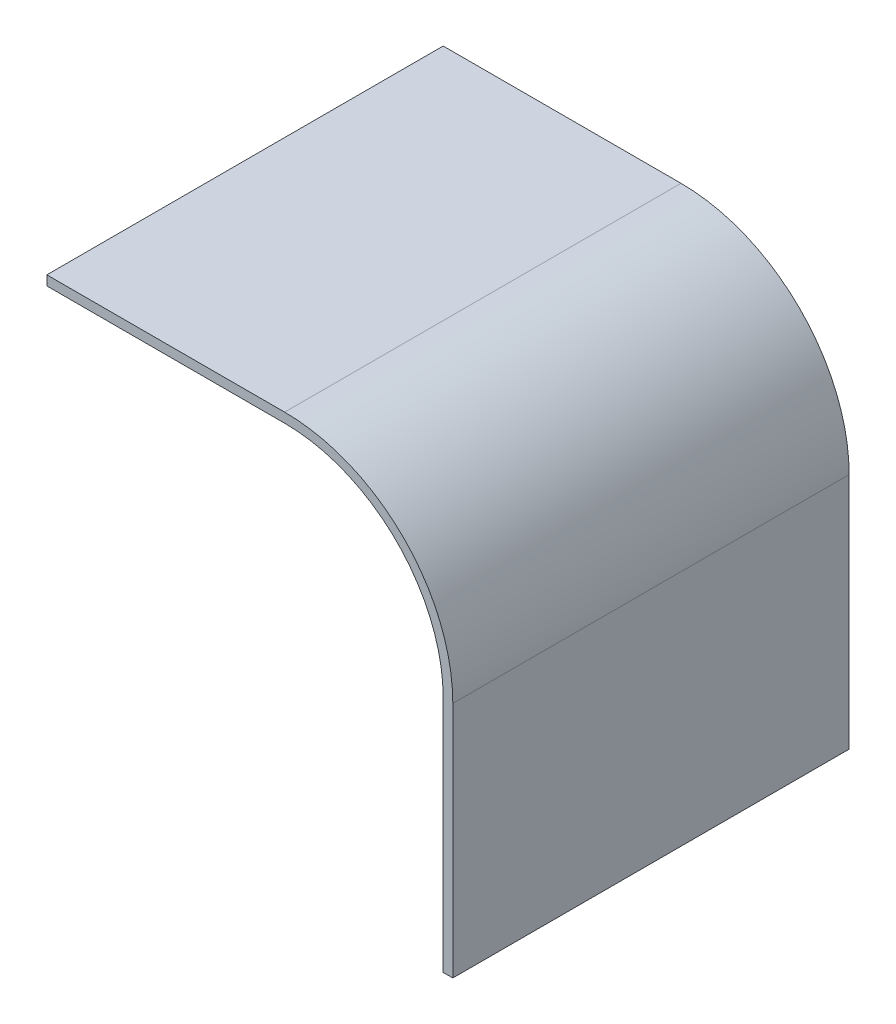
ISO-10303-21;
HEADER;
FILE_DESCRIPTION(('STEP AP214'),'2;1');
FILE_NAME('part.step','',(''),(''),'','','');
FILE_SCHEMA(('AUTOMOTIVE_DESIGN { 1 0 10303 214 1 1 1 1 }'));
ENDSEC;
DATA;
#1=APPLICATION_CONTEXT('core data for automotive mechanical design processes');
#2=APPLICATION_PROTOCOL_DEFINITION('international standard','automotive_design',2000,#1);
#3=PRODUCT_CONTEXT('',#1,'mechanical');
#4=PRODUCT('Part','Part','',(#3));
#5=PRODUCT_RELATED_PRODUCT_CATEGORY('part','',(#4));
#6=PRODUCT_DEFINITION_FORMATION('','',#4);
#7=PRODUCT_DEFINITION_CONTEXT('part definition',#1,'design');
#8=PRODUCT_DEFINITION('design','',#6,#7);
#9=PRODUCT_DEFINITION_SHAPE('','',#8);
#10=(LENGTH_UNIT() NAMED_UNIT(*) SI_UNIT(.MILLI.,.METRE.));
#11=(NAMED_UNIT(*) PLANE_ANGLE_UNIT() SI_UNIT($,.RADIAN.));
#12=(NAMED_UNIT(*) SI_UNIT($,.STERADIAN.) SOLID_ANGLE_UNIT());
#13=UNCERTAINTY_MEASURE_WITH_UNIT(LENGTH_MEASURE(1.E-05),#10,'distance_accuracy_value','');
#14=(GEOMETRIC_REPRESENTATION_CONTEXT(3) GLOBAL_UNCERTAINTY_ASSIGNED_CONTEXT((#13)) GLOBAL_UNIT_ASSIGNED_CONTEXT((#10,
#11,#12)) REPRESENTATION_CONTEXT('',''));
#15=CARTESIAN_POINT('',(0.,0.,0.));
#16=DIRECTION('',(0.,0.,1.));
#17=DIRECTION('',(1.,0.,0.));
#18=AXIS2_PLACEMENT_3D('',#15,#16,#17);
#19=CARTESIAN_POINT('',(30.,1.214,50.));
#20=DIRECTION('',(0.,-1.,0.));
#21=DIRECTION('',(1.,0.,0.));
#22=AXIS2_PLACEMENT_3D('',#19,#20,#21);
#23=PLANE('',#22);
#24=DIRECTION('',(-1.,0.,0.));
#25=VECTOR('',#24,1.);
#26=CARTESIAN_POINT('',(30.,1.214,0.));
#27=LINE('',#26,#25);
#28=CARTESIAN_POINT('',(30.,1.214,0.));
#29=VERTEX_POINT('',#28);
#30=CARTESIAN_POINT('',(0.,1.214,0.));
#31=VERTEX_POINT('',#30);
#32=EDGE_CURVE('E127',#29,#31,#27,.T.);
#33=ORIENTED_EDGE('',*,*,#32,.T.);
#34=DIRECTION('',(0.,0.,-1.));
#35=VECTOR('',#34,1.);
#36=CARTESIAN_POINT('',(0.,1.214,50.));
#37=LINE('',#36,#35);
#38=CARTESIAN_POINT('',(0.,1.214,50.));
#39=VERTEX_POINT('',#38);
#40=EDGE_CURVE('E11',#39,#31,#37,.T.);
#41=ORIENTED_EDGE('',*,*,#40,.F.);
#42=DIRECTION('',(-1.,0.,0.));
#43=VECTOR('',#42,1.);
#44=CARTESIAN_POINT('',(30.,1.214,50.));
#45=LINE('',#44,#43);
#46=CARTESIAN_POINT('',(30.,1.214,50.));
#47=VERTEX_POINT('',#46);
#48=EDGE_CURVE('E85',#47,#39,#45,.T.);
#49=ORIENTED_EDGE('',*,*,#48,.F.);
#50=DIRECTION('',(0.,0.,-1.));
#51=VECTOR('',#50,1.);
#52=CARTESIAN_POINT('',(30.,1.214,50.));
#53=LINE('',#52,#51);
#54=EDGE_CURVE('E126',#47,#29,#53,.T.);
#55=ORIENTED_EDGE('',*,*,#54,.T.);
#56=EDGE_LOOP('',(#33,#41,#49,#55));
#57=FACE_BOUND('',#56,.T.);
#58=ADVANCED_FACE('F30',(#57),#23,.F.);
#59=CARTESIAN_POINT('',(0.,0.,50.));
#60=DIRECTION('',(-1.,0.,0.));
#61=DIRECTION('',(0.,0.,1.));
#62=AXIS2_PLACEMENT_3D('',#59,#60,#61);
#63=PLANE('',#62);
#64=DIRECTION('',(0.,1.,0.));
#65=VECTOR('',#64,1.);
#66=CARTESIAN_POINT('',(0.,0.,0.));
#67=LINE('',#66,#65);
#68=CARTESIAN_POINT('',(0.,0.,0.));
#69=VERTEX_POINT('',#68);
#70=EDGE_CURVE('E130',#69,#31,#67,.T.);
#71=ORIENTED_EDGE('',*,*,#70,.F.);
#72=DIRECTION('',(0.,0.,-1.));
#73=VECTOR('',#72,1.);
#74=CARTESIAN_POINT('',(0.,0.,50.));
#75=LINE('',#74,#73);
#76=CARTESIAN_POINT('',(0.,0.,50.));
#77=VERTEX_POINT('',#76);
#78=EDGE_CURVE('E38',#77,#69,#75,.T.);
#79=ORIENTED_EDGE('',*,*,#78,.F.);
#80=DIRECTION('',(0.,1.,0.));
#81=VECTOR('',#80,1.);
#82=CARTESIAN_POINT('',(0.,0.,50.));
#83=LINE('',#82,#81);
#84=EDGE_CURVE('E169',#77,#39,#83,.T.);
#85=ORIENTED_EDGE('',*,*,#84,.T.);
#86=ORIENTED_EDGE('',*,*,#40,.T.);
#87=EDGE_LOOP('',(#71,#79,#85,#86));
#88=FACE_BOUND('',#87,.T.);
#89=ADVANCED_FACE('F160',(#88),#63,.T.);
#90=CARTESIAN_POINT('',(30.,0.,50.));
#91=DIRECTION('',(0.,-1.,0.));
#92=DIRECTION('',(1.,0.,0.));
#93=AXIS2_PLACEMENT_3D('',#90,#91,#92);
#94=PLANE('',#93);
#95=DIRECTION('',(-1.,0.,0.));
#96=VECTOR('',#95,1.);
#97=CARTESIAN_POINT('',(30.,0.,0.));
#98=LINE('',#97,#96);
#99=CARTESIAN_POINT('',(30.,0.,0.));
#100=VERTEX_POINT('',#99);
#101=EDGE_CURVE('E133',#100,#69,#98,.T.);
#102=ORIENTED_EDGE('',*,*,#101,.F.);
#103=DIRECTION('',(0.,0.,-1.));
#104=VECTOR('',#103,1.);
#105=CARTESIAN_POINT('',(30.,0.,50.));
#106=LINE('',#105,#104);
#107=CARTESIAN_POINT('',(30.,0.,50.));
#108=VERTEX_POINT('',#107);
#109=EDGE_CURVE('E150',#108,#100,#106,.T.);
#110=ORIENTED_EDGE('',*,*,#109,.F.);
#111=DIRECTION('',(-1.,0.,0.));
#112=VECTOR('',#111,1.);
#113=CARTESIAN_POINT('',(30.,0.,50.));
#114=LINE('',#113,#112);
#115=EDGE_CURVE('E157',#108,#77,#114,.T.);
#116=ORIENTED_EDGE('',*,*,#115,.T.);
#117=ORIENTED_EDGE('',*,*,#78,.T.);
#118=EDGE_LOOP('',(#102,#110,#116,#117));
#119=FACE_BOUND('',#118,.T.);
#120=ADVANCED_FACE('F155',(#119),#94,.T.);
#121=CARTESIAN_POINT('',(30.,-20.,50.));
#122=DIRECTION('',(0.,0.,-1.));
#123=DIRECTION('',(-1.,0.,0.));
#124=AXIS2_PLACEMENT_3D('',#121,#122,#123);
#125=CYLINDRICAL_SURFACE('',#124,20.);
#126=CARTESIAN_POINT('',(30.,-20.,0.));
#127=DIRECTION('',(0.,0.,1.));
#128=DIRECTION('',(1.,0.,0.));
#129=AXIS2_PLACEMENT_3D('',#126,#127,#128);
#130=CIRCLE('',#129,20.);
#131=CARTESIAN_POINT('',(50.,-20.,0.));
#132=VERTEX_POINT('',#131);
#133=EDGE_CURVE('E136',#132,#100,#130,.T.);
#134=ORIENTED_EDGE('',*,*,#133,.F.);
#135=DIRECTION('',(0.,0.,-1.));
#136=VECTOR('',#135,1.);
#137=CARTESIAN_POINT('',(50.,-20.,50.));
#138=LINE('',#137,#136);
#139=CARTESIAN_POINT('',(50.,-20.,50.));
#140=VERTEX_POINT('',#139);
#141=EDGE_CURVE('E148',#140,#132,#138,.T.);
#142=ORIENTED_EDGE('',*,*,#141,.F.);
#143=CARTESIAN_POINT('',(30.,-20.,50.));
#144=DIRECTION('',(0.,0.,1.));
#145=DIRECTION('',(1.,0.,0.));
#146=AXIS2_PLACEMENT_3D('',#143,#144,#145);
#147=CIRCLE('',#146,20.);
#148=EDGE_CURVE('E121',#140,#108,#147,.T.);
#149=ORIENTED_EDGE('',*,*,#148,.T.);
#150=ORIENTED_EDGE('',*,*,#109,.T.);
#151=EDGE_LOOP('',(#134,#142,#149,#150));
#152=FACE_BOUND('',#151,.T.);
#153=ADVANCED_FACE('F167',(#152),#125,.F.);
#154=CARTESIAN_POINT('',(50.,-50.,50.));
#155=DIRECTION('',(-1.,0.,0.));
#156=DIRECTION('',(0.,0.,1.));
#157=AXIS2_PLACEMENT_3D('',#154,#155,#156);
#158=PLANE('',#157);
#159=DIRECTION('',(0.,1.,0.));
#160=VECTOR('',#159,1.);
#161=CARTESIAN_POINT('',(50.,-50.,0.));
#162=LINE('',#161,#160);
#163=CARTESIAN_POINT('',(50.,-50.,0.));
#164=VERTEX_POINT('',#163);
#165=EDGE_CURVE('E139',#164,#132,#162,.T.);
#166=ORIENTED_EDGE('',*,*,#165,.F.);
#167=DIRECTION('',(0.,0.,-1.));
#168=VECTOR('',#167,1.);
#169=CARTESIAN_POINT('',(50.,-50.,50.));
#170=LINE('',#169,#168);
#171=CARTESIAN_POINT('',(50.,-50.,50.));
#172=VERTEX_POINT('',#171);
#173=EDGE_CURVE('E109',#172,#164,#170,.T.);
#174=ORIENTED_EDGE('',*,*,#173,.F.);
#175=DIRECTION('',(0.,1.,0.));
#176=VECTOR('',#175,1.);
#177=CARTESIAN_POINT('',(50.,-50.,50.));
#178=LINE('',#177,#176);
#179=EDGE_CURVE('E119',#172,#140,#178,.T.);
#180=ORIENTED_EDGE('',*,*,#179,.T.);
#181=ORIENTED_EDGE('',*,*,#141,.T.);
#182=EDGE_LOOP('',(#166,#174,#180,#181));
#183=FACE_BOUND('',#182,.T.);
#184=ADVANCED_FACE('F174',(#183),#158,.T.);
#185=CARTESIAN_POINT('',(51.214,-50.,50.));
#186=DIRECTION('',(0.,-1.,0.));
#187=DIRECTION('',(0.,0.,-1.));
#188=AXIS2_PLACEMENT_3D('',#185,#186,#187);
#189=PLANE('',#188);
#190=DIRECTION('',(-1.,0.,0.));
#191=VECTOR('',#190,1.);
#192=CARTESIAN_POINT('',(51.214,-50.,0.));
#193=LINE('',#192,#191);
#194=CARTESIAN_POINT('',(51.214,-50.,0.));
#195=VERTEX_POINT('',#194);
#196=EDGE_CURVE('E108',#195,#164,#193,.T.);
#197=ORIENTED_EDGE('',*,*,#196,.F.);
#198=DIRECTION('',(0.,0.,-1.));
#199=VECTOR('',#198,1.);
#200=CARTESIAN_POINT('',(51.214,-50.,50.));
#201=LINE('',#200,#199);
#202=CARTESIAN_POINT('',(51.214,-50.,50.));
#203=VERTEX_POINT('',#202);
#204=EDGE_CURVE('E102',#203,#195,#201,.T.);
#205=ORIENTED_EDGE('',*,*,#204,.F.);
#206=DIRECTION('',(-1.,0.,0.));
#207=VECTOR('',#206,1.);
#208=CARTESIAN_POINT('',(51.214,-50.,50.));
#209=LINE('',#208,#207);
#210=EDGE_CURVE('E106',#203,#172,#209,.T.);
#211=ORIENTED_EDGE('',*,*,#210,.T.);
#212=ORIENTED_EDGE('',*,*,#173,.T.);
#213=EDGE_LOOP('',(#197,#205,#211,#212));
#214=FACE_BOUND('',#213,.T.);
#215=ADVANCED_FACE('F104',(#214),#189,.T.);
#216=CARTESIAN_POINT('',(51.214,-50.,50.));
#217=DIRECTION('',(-1.,0.,0.));
#218=DIRECTION('',(0.,0.,1.));
#219=AXIS2_PLACEMENT_3D('',#216,#217,#218);
#220=PLANE('',#219);
#221=DIRECTION('',(0.,1.,0.));
#222=VECTOR('',#221,1.);
#223=CARTESIAN_POINT('',(51.214,-50.,0.));
#224=LINE('',#223,#222);
#225=CARTESIAN_POINT('',(51.214,-20.,0.));
#226=VERTEX_POINT('',#225);
#227=EDGE_CURVE('E73',#195,#226,#224,.T.);
#228=ORIENTED_EDGE('',*,*,#227,.T.);
#229=DIRECTION('',(0.,0.,-1.));
#230=VECTOR('',#229,1.);
#231=CARTESIAN_POINT('',(51.214,-20.,50.));
#232=LINE('',#231,#230);
#233=CARTESIAN_POINT('',(51.214,-20.,50.));
#234=VERTEX_POINT('',#233);
#235=EDGE_CURVE('E110',#234,#226,#232,.T.);
#236=ORIENTED_EDGE('',*,*,#235,.F.);
#237=DIRECTION('',(0.,1.,0.));
#238=VECTOR('',#237,1.);
#239=CARTESIAN_POINT('',(51.214,-50.,50.));
#240=LINE('',#239,#238);
#241=EDGE_CURVE('E112',#203,#234,#240,.T.);
#242=ORIENTED_EDGE('',*,*,#241,.F.);
#243=ORIENTED_EDGE('',*,*,#204,.T.);
#244=EDGE_LOOP('',(#228,#236,#242,#243));
#245=FACE_BOUND('',#244,.T.);
#246=ADVANCED_FACE('F113',(#245),#220,.F.);
#247=CARTESIAN_POINT('',(30.,-20.,50.));
#248=DIRECTION('',(0.,0.,-1.));
#249=DIRECTION('',(-1.,0.,0.));
#250=AXIS2_PLACEMENT_3D('',#247,#248,#249);
#251=CYLINDRICAL_SURFACE('',#250,21.214);
#252=CARTESIAN_POINT('',(30.,-20.,0.));
#253=DIRECTION('',(0.,0.,1.));
#254=DIRECTION('',(1.,0.,0.));
#255=AXIS2_PLACEMENT_3D('',#252,#253,#254);
#256=CIRCLE('',#255,21.214);
#257=EDGE_CURVE('E79',#226,#29,#256,.T.);
#258=ORIENTED_EDGE('',*,*,#257,.T.);
#259=ORIENTED_EDGE('',*,*,#54,.F.);
#260=CARTESIAN_POINT('',(30.,-20.,50.));
#261=DIRECTION('',(0.,0.,1.));
#262=DIRECTION('',(1.,0.,0.));
#263=AXIS2_PLACEMENT_3D('',#260,#261,#262);
#264=CIRCLE('',#263,21.214);
#265=EDGE_CURVE('E46',#234,#47,#264,.T.);
#266=ORIENTED_EDGE('',*,*,#265,.F.);
#267=ORIENTED_EDGE('',*,*,#235,.T.);
#268=EDGE_LOOP('',(#258,#259,#266,#267));
#269=FACE_BOUND('',#268,.T.);
#270=ADVANCED_FACE('F176',(#269),#251,.T.);
#271=CARTESIAN_POINT('',(30.,-20.,50.));
#272=DIRECTION('',(0.,0.,1.));
#273=DIRECTION('',(1.,0.,0.));
#274=AXIS2_PLACEMENT_3D('',#271,#272,#273);
#275=PLANE('',#274);
#276=ORIENTED_EDGE('',*,*,#48,.T.);
#277=ORIENTED_EDGE('',*,*,#84,.F.);
#278=ORIENTED_EDGE('',*,*,#115,.F.);
#279=ORIENTED_EDGE('',*,*,#148,.F.);
#280=ORIENTED_EDGE('',*,*,#179,.F.);
#281=ORIENTED_EDGE('',*,*,#210,.F.);
#282=ORIENTED_EDGE('',*,*,#241,.T.);
#283=ORIENTED_EDGE('',*,*,#265,.T.);
#284=EDGE_LOOP('',(#276,#277,#278,#279,#280,#281,#282,#283));
#285=FACE_BOUND('',#284,.T.);
#286=ADVANCED_FACE('F116',(#285),#275,.T.);
#287=CARTESIAN_POINT('',(30.,-20.,0.));
#288=DIRECTION('',(0.,0.,1.));
#289=DIRECTION('',(1.,0.,0.));
#290=AXIS2_PLACEMENT_3D('',#287,#288,#289);
#291=PLANE('',#290);
#292=ORIENTED_EDGE('',*,*,#32,.F.);
#293=ORIENTED_EDGE('',*,*,#257,.F.);
#294=ORIENTED_EDGE('',*,*,#227,.F.);
#295=ORIENTED_EDGE('',*,*,#196,.T.);
#296=ORIENTED_EDGE('',*,*,#165,.T.);
#297=ORIENTED_EDGE('',*,*,#133,.T.);
#298=ORIENTED_EDGE('',*,*,#101,.T.);
#299=ORIENTED_EDGE('',*,*,#70,.T.);
#300=EDGE_LOOP('',(#292,#293,#294,#295,#296,#297,#298,#299));
#301=FACE_BOUND('',#300,.T.);
#302=ADVANCED_FACE('F163',(#301),#291,.F.);
#303=CLOSED_SHELL('',(#58,#89,#120,#153,#184,#215,#246,#270,#286,#302));
#304=MANIFOLD_SOLID_BREP('B2',#303);
#305=ADVANCED_BREP_SHAPE_REPRESENTATION('',(#18,#304),#14);
#306=SHAPE_DEFINITION_REPRESENTATION(#9,#305);
ENDSEC;
END-ISO-10303-21;
